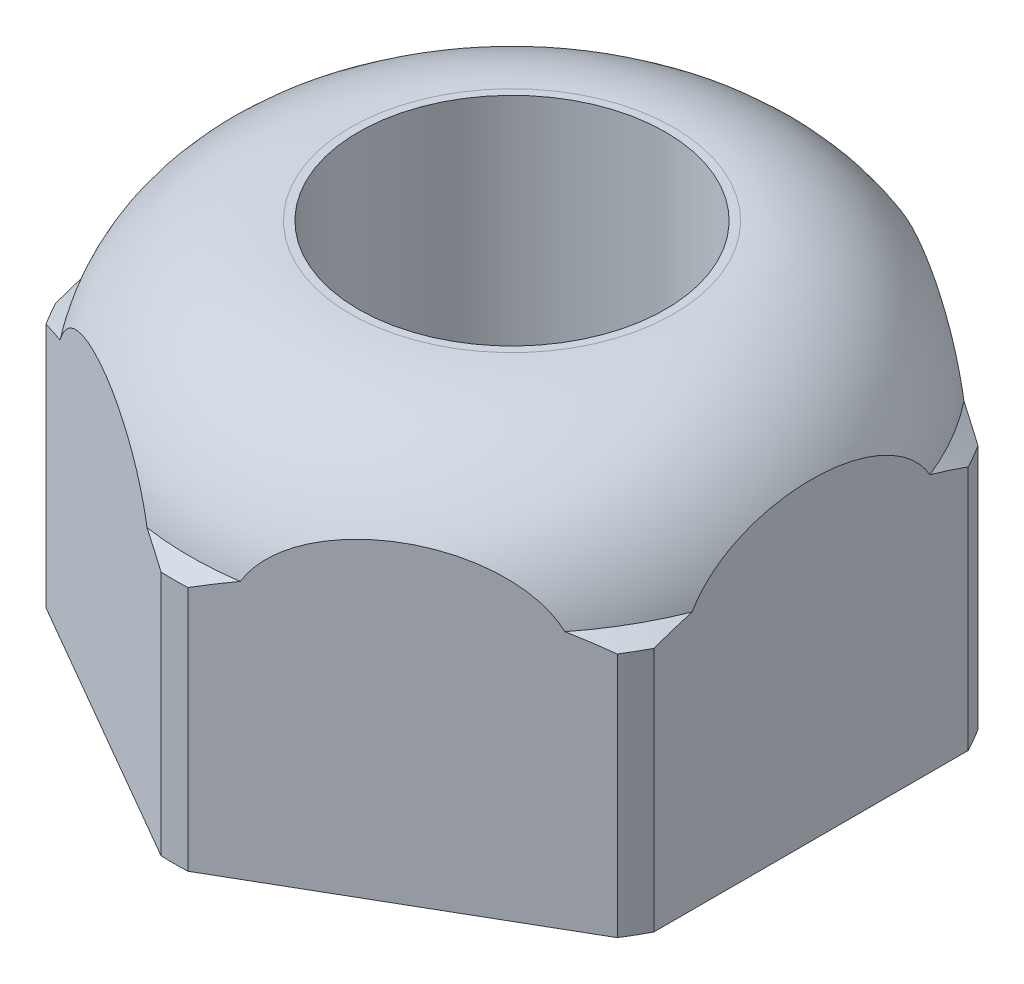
from build123d import *

# Parameters (mm, degrees)
SKETCH2_W          = 40.483291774
SKETCH2_H          = 39.090746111
CUT_EXTRUDE1_DEPTH = 31.699192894


with BuildPart() as part:
    # Sketch1 → Base-Revolve (revolve)
    with BuildSketch(Plane.XY, mode=Mode.PRIVATE) as base_revolve_sk:
        with BuildLine():
            Line((2.413, 0), (2.413, 6.096))
            Line((2.413, 6.096), (2.54, 6.096))
            ThreePointArc((2.54, 6.096), (4.16035084, 5.521322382), (5.056526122, 4.054127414))
            Line((5.056526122, 4.054127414), (5.3086, 3.8608))
            Line((5.3086, 3.8608), (5.3086, 0))
            Line((5.3086, 0), (2.413, 0))
        make_face()
    revolve(base_revolve_sk.sketch.rotate(Axis((0, -25.4, 0), (0, 1, 0)), 90), axis=Axis((0, -25.4, 0), (0, 1, 0)))

    # Sketch2 → Cut-Extrude1 (cut)
    with BuildSketch(Plane(origin=(0, 0, 0), x_dir=(1, 0, 0), z_dir=(0, 1, 0))):
        with Locations((0.511079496, 0.007923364)):
            Rectangle(SKETCH2_W, SKETCH2_H)
        Polygon((4.699, 2.712968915), (0, 5.42593783), (-4.699, 2.712968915), (-4.699, -2.712968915), (0, -5.42593783), (4.699, -2.712968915), align=None, mode=Mode.SUBTRACT)
    extrude(amount=CUT_EXTRUDE1_DEPTH, mode=Mode.SUBTRACT)


solid = part.part
